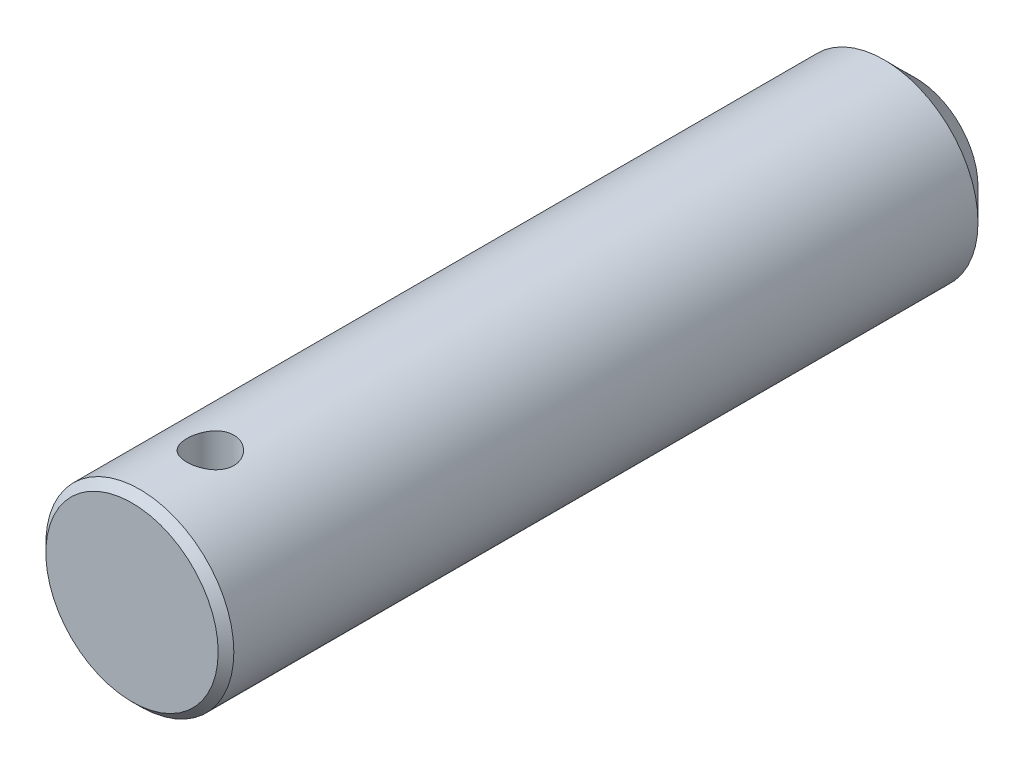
ISO-10303-21;
HEADER;
FILE_DESCRIPTION(('STEP AP214'),'2;1');
FILE_NAME('part.step','',(''),(''),'','','');
FILE_SCHEMA(('AUTOMOTIVE_DESIGN { 1 0 10303 214 1 1 1 1 }'));
ENDSEC;
DATA;
#1=APPLICATION_CONTEXT('core data for automotive mechanical design processes');
#2=APPLICATION_PROTOCOL_DEFINITION('international standard','automotive_design',2000,#1);
#3=PRODUCT_CONTEXT('',#1,'mechanical');
#4=PRODUCT('Part','Part','',(#3));
#5=PRODUCT_RELATED_PRODUCT_CATEGORY('part','',(#4));
#6=PRODUCT_DEFINITION_FORMATION('','',#4);
#7=PRODUCT_DEFINITION_CONTEXT('part definition',#1,'design');
#8=PRODUCT_DEFINITION('design','',#6,#7);
#9=PRODUCT_DEFINITION_SHAPE('','',#8);
#10=(LENGTH_UNIT() NAMED_UNIT(*) SI_UNIT(.MILLI.,.METRE.));
#11=(NAMED_UNIT(*) PLANE_ANGLE_UNIT() SI_UNIT($,.RADIAN.));
#12=(NAMED_UNIT(*) SI_UNIT($,.STERADIAN.) SOLID_ANGLE_UNIT());
#13=UNCERTAINTY_MEASURE_WITH_UNIT(LENGTH_MEASURE(1.E-05),#10,'distance_accuracy_value','');
#14=(GEOMETRIC_REPRESENTATION_CONTEXT(3) GLOBAL_UNCERTAINTY_ASSIGNED_CONTEXT((#13)) GLOBAL_UNIT_ASSIGNED_CONTEXT((#10,
#11,#12)) REPRESENTATION_CONTEXT('',''));
#15=CARTESIAN_POINT('',(0.,0.,0.));
#16=DIRECTION('',(0.,0.,1.));
#17=DIRECTION('',(1.,0.,0.));
#18=AXIS2_PLACEMENT_3D('',#15,#16,#17);
#19=CARTESIAN_POINT('',(0.,0.,50.));
#20=DIRECTION('',(0.,0.,-1.));
#21=DIRECTION('',(-1.,0.,0.));
#22=AXIS2_PLACEMENT_3D('',#19,#20,#21);
#23=CYLINDRICAL_SURFACE('',#22,6.);
#24=CARTESIAN_POINT('',(0.,0.,49.5));
#25=DIRECTION('',(0.,0.,1.));
#26=DIRECTION('',(1.,0.,0.));
#27=AXIS2_PLACEMENT_3D('',#24,#25,#26);
#28=CIRCLE('',#27,6.);
#29=CARTESIAN_POINT('',(6.,0.,49.5));
#30=VERTEX_POINT('',#29);
#31=EDGE_CURVE('E10',#30,#30,#28,.F.);
#32=ORIENTED_EDGE('',*,*,#31,.T.);
#33=EDGE_LOOP('',(#32));
#34=FACE_BOUND('',#33,.T.);
#35=CARTESIAN_POINT('',(0.,-6.,46.5));
#36=CARTESIAN_POINT('',(0.0828760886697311,-5.99999859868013,46.4999976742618));
#37=CARTESIAN_POINT('',(0.165778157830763,-5.99826578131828,46.4931084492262));
#38=CARTESIAN_POINT('',(0.329206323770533,-5.99152113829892,46.465774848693));
#39=CARTESIAN_POINT('',(0.40973104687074,-5.98650745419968,46.4453227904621));
#40=CARTESIAN_POINT('',(0.566020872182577,-5.9737562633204,46.3915607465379));
#41=CARTESIAN_POINT('',(0.641791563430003,-5.96602202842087,46.3582662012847));
#42=CARTESIAN_POINT('',(0.786672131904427,-5.94865343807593,46.2798186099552));
#43=CARTESIAN_POINT('',(0.85578178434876,-5.9390190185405,46.2346651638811));
#44=CARTESIAN_POINT('',(0.986801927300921,-5.91867413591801,46.1327992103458));
#45=CARTESIAN_POINT('',(1.04855569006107,-5.90794707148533,46.0758884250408));
#46=CARTESIAN_POINT('',(1.1617489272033,-5.8867362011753,45.9525477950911));
#47=CARTESIAN_POINT('',(1.21318723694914,-5.87625242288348,45.8861168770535));
#48=CARTESIAN_POINT('',(1.30502654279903,-5.8565477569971,45.7444047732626));
#49=CARTESIAN_POINT('',(1.34525221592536,-5.84734794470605,45.6690067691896));
#50=CARTESIAN_POINT('',(1.41239690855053,-5.83149494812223,45.5122515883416));
#51=CARTESIAN_POINT('',(1.43931805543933,-5.82484135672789,45.4308953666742));
#52=CARTESIAN_POINT('',(1.47855483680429,-5.81500476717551,45.2662565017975));
#53=CARTESIAN_POINT('',(1.49115226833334,-5.81175491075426,45.1830451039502));
#54=CARTESIAN_POINT('',(1.50226177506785,-5.80889362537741,45.015631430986));
#55=CARTESIAN_POINT('',(1.50077614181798,-5.80928160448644,44.9314293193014));
#56=CARTESIAN_POINT('',(1.48398652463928,-5.81359205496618,44.7665841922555));
#57=CARTESIAN_POINT('',(1.46901834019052,-5.81742863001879,44.6859043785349));
#58=CARTESIAN_POINT('',(1.42622418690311,-5.82806709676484,44.5282389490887));
#59=CARTESIAN_POINT('',(1.39839730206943,-5.83486919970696,44.451253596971));
#60=CARTESIAN_POINT('',(1.33038947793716,-5.85075113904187,44.3022619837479));
#61=CARTESIAN_POINT('',(1.29008666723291,-5.85985327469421,44.2303138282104));
#62=CARTESIAN_POINT('',(1.19835627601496,-5.87929710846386,44.0940812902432));
#63=CARTESIAN_POINT('',(1.14692674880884,-5.88963902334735,44.0297982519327));
#64=CARTESIAN_POINT('',(1.03266342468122,-5.91075880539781,43.9087963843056));
#65=CARTESIAN_POINT('',(0.969546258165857,-5.92154069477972,43.8523455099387));
#66=CARTESIAN_POINT('',(0.834611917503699,-5.94205965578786,43.7507787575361));
#67=CARTESIAN_POINT('',(0.762794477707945,-5.95179669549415,43.7056632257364));
#68=CARTESIAN_POINT('',(0.612115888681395,-5.96917732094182,43.6279494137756));
#69=CARTESIAN_POINT('',(0.533231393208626,-5.97681360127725,43.5953946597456));
#70=CARTESIAN_POINT('',(0.370876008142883,-5.98907916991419,43.5440826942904));
#71=CARTESIAN_POINT('',(0.287405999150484,-5.99370903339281,43.5253228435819));
#72=CARTESIAN_POINT('',(0.120539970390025,-5.99935499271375,43.5025424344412));
#73=CARTESIAN_POINT('',(0.0371967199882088,-6.00046053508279,43.4981569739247));
#74=CARTESIAN_POINT('',(-0.129032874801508,-5.99918804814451,43.5032490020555));
#75=CARTESIAN_POINT('',(-0.211919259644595,-5.99681033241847,43.5127252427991));
#76=CARTESIAN_POINT('',(-0.373614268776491,-5.98889581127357,43.5449709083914));
#77=CARTESIAN_POINT('',(-0.452465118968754,-5.98340634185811,43.567541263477));
#78=CARTESIAN_POINT('',(-0.605257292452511,-5.96988706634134,43.6251070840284));
#79=CARTESIAN_POINT('',(-0.679198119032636,-5.96185700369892,43.6601038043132));
#80=CARTESIAN_POINT('',(-0.821523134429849,-5.9439330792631,43.7422361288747));
#81=CARTESIAN_POINT('',(-0.889785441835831,-5.93400867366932,43.7895761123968));
#82=CARTESIAN_POINT('',(-1.01752661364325,-5.91344509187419,43.894789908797));
#83=CARTESIAN_POINT('',(-1.07700395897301,-5.90280579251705,43.9526655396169));
#84=CARTESIAN_POINT('',(-1.18699056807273,-5.88168956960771,44.0790019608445));
#85=CARTESIAN_POINT('',(-1.23724386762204,-5.87122304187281,44.1476877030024));
#86=CARTESIAN_POINT('',(-1.3255107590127,-5.85192878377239,44.2927326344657));
#87=CARTESIAN_POINT('',(-1.36352489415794,-5.84310098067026,44.3690914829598));
#88=CARTESIAN_POINT('',(-1.42595142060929,-5.82818094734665,44.5269057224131));
#89=CARTESIAN_POINT('',(-1.45044439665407,-5.82207255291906,44.608327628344));
#90=CARTESIAN_POINT('',(-1.48534565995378,-5.81326744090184,44.7743096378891));
#91=CARTESIAN_POINT('',(-1.49575702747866,-5.81056997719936,44.8588690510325));
#92=CARTESIAN_POINT('',(-1.502038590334,-5.80894901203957,45.0261210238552));
#93=CARTESIAN_POINT('',(-1.49831789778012,-5.80991932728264,45.1087974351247));
#94=CARTESIAN_POINT('',(-1.47737727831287,-5.81527909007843,45.272303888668));
#95=CARTESIAN_POINT('',(-1.46015762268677,-5.81966846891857,45.3531339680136));
#96=CARTESIAN_POINT('',(-1.4129313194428,-5.83131260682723,45.5102084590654));
#97=CARTESIAN_POINT('',(-1.38300140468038,-5.83855015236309,45.5864773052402));
#98=CARTESIAN_POINT('',(-1.31126491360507,-5.85507755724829,45.7329653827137));
#99=CARTESIAN_POINT('',(-1.26945669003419,-5.86436770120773,45.8031837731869));
#100=CARTESIAN_POINT('',(-1.17386774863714,-5.88425634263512,45.937554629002));
#101=CARTESIAN_POINT('',(-1.11980316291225,-5.89488264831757,46.001501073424));
#102=CARTESIAN_POINT('',(-1.00178937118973,-5.91608027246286,46.1195470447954));
#103=CARTESIAN_POINT('',(-0.937837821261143,-5.9266515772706,46.173644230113));
#104=CARTESIAN_POINT('',(-0.800467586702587,-5.94677655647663,46.2714113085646));
#105=CARTESIAN_POINT('',(-0.726898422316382,-5.95630833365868,46.3148746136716));
#106=CARTESIAN_POINT('',(-0.573266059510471,-5.97304924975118,46.3887474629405));
#107=CARTESIAN_POINT('',(-0.493207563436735,-5.98026005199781,46.4191663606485));
#108=CARTESIAN_POINT('',(-0.34441025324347,-5.99048059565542,46.4615718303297));
#109=CARTESIAN_POINT('',(-0.276380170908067,-5.99402585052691,46.4759512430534));
#110=CARTESIAN_POINT('',(-0.138906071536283,-5.99878605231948,46.4951659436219));
#111=CARTESIAN_POINT('',(-0.0694621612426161,-6.00000117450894,46.5000019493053));
#112=CARTESIAN_POINT('',(0.,-6.,46.5));
#113=B_SPLINE_CURVE_WITH_KNOTS('',3,(#35,#36,#37,#38,#39,#40,#41,#42,#43,#44,#45,#46,#47,#48,
#49,#50,#51,#52,#53,#54,#55,#56,#57,#58,#59,#60,#61,#62,#63,#64,#65,#66,#67,#68,#69,#70,#71,#72,
#73,#74,#75,#76,#77,#78,#79,#80,#81,#82,#83,#84,#85,#86,#87,#88,#89,#90,#91,#92,#93,#94,#95,#96,
#97,#98,#99,#100,#101,#102,#103,#104,#105,#106,#107,#108,#109,#110,#111,#112),.UNSPECIFIED.,.T.,
.F.,(4,2,2,2,2,2,2,2,2,2,2,2,2,2,2,2,2,2,2,2,2,2,2,2,2,2,2,2,2,2,2,2,2,2,2,2,2,2,4),(0.,
0.248373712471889,0.4968882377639,0.745104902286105,0.993329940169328,1.24614435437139,
1.49898729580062,1.75558647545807,2.01214461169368,2.2635629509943,2.51494038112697,
2.76022497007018,3.00552703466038,3.25330527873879,3.50112690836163,3.7560150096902,
4.01091089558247,4.26668229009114,4.52240473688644,4.77158308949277,5.02073901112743,
5.26620274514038,5.51169127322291,5.76153587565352,6.0114236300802,6.26744509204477,
6.52345518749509,6.77792254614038,7.03233423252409,7.27943780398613,7.52653640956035,
7.77216400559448,8.01782568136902,8.26989576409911,8.52202569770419,8.77872185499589,
9.03523363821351,9.2434224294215,9.4515955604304),.UNSPECIFIED.);
#114=CARTESIAN_POINT('',(0.,-6.,46.5));
#115=VERTEX_POINT('',#114);
#116=EDGE_CURVE('E51',#115,#115,#113,.T.);
#117=ORIENTED_EDGE('',*,*,#116,.T.);
#118=EDGE_LOOP('',(#117));
#119=FACE_BOUND('',#118,.T.);
#120=CARTESIAN_POINT('',(0.,6.,46.5));
#121=CARTESIAN_POINT('',(-0.0828760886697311,5.99999859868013,46.4999976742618));
#122=CARTESIAN_POINT('',(-0.165778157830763,5.99826578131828,46.4931084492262));
#123=CARTESIAN_POINT('',(-0.329206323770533,5.99152113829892,46.465774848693));
#124=CARTESIAN_POINT('',(-0.40973104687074,5.98650745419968,46.4453227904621));
#125=CARTESIAN_POINT('',(-0.566020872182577,5.9737562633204,46.3915607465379));
#126=CARTESIAN_POINT('',(-0.641791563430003,5.96602202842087,46.3582662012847));
#127=CARTESIAN_POINT('',(-0.786672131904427,5.94865343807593,46.2798186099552));
#128=CARTESIAN_POINT('',(-0.85578178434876,5.9390190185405,46.2346651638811));
#129=CARTESIAN_POINT('',(-0.986801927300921,5.91867413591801,46.1327992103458));
#130=CARTESIAN_POINT('',(-1.04855569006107,5.90794707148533,46.0758884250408));
#131=CARTESIAN_POINT('',(-1.1617489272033,5.8867362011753,45.9525477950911));
#132=CARTESIAN_POINT('',(-1.21318723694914,5.87625242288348,45.8861168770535));
#133=CARTESIAN_POINT('',(-1.30502654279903,5.8565477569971,45.7444047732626));
#134=CARTESIAN_POINT('',(-1.34525221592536,5.84734794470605,45.6690067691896));
#135=CARTESIAN_POINT('',(-1.41239690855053,5.83149494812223,45.5122515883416));
#136=CARTESIAN_POINT('',(-1.43931805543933,5.82484135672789,45.4308953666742));
#137=CARTESIAN_POINT('',(-1.47855483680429,5.81500476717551,45.2662565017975));
#138=CARTESIAN_POINT('',(-1.49115226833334,5.81175491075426,45.1830451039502));
#139=CARTESIAN_POINT('',(-1.50226177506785,5.80889362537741,45.015631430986));
#140=CARTESIAN_POINT('',(-1.50077614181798,5.80928160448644,44.9314293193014));
#141=CARTESIAN_POINT('',(-1.48398652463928,5.81359205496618,44.7665841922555));
#142=CARTESIAN_POINT('',(-1.46901834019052,5.81742863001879,44.6859043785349));
#143=CARTESIAN_POINT('',(-1.42622418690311,5.82806709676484,44.5282389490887));
#144=CARTESIAN_POINT('',(-1.39839730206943,5.83486919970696,44.451253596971));
#145=CARTESIAN_POINT('',(-1.33038947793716,5.85075113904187,44.3022619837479));
#146=CARTESIAN_POINT('',(-1.29008666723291,5.85985327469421,44.2303138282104));
#147=CARTESIAN_POINT('',(-1.19835627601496,5.87929710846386,44.0940812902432));
#148=CARTESIAN_POINT('',(-1.14692674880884,5.88963902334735,44.0297982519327));
#149=CARTESIAN_POINT('',(-1.03266342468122,5.91075880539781,43.9087963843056));
#150=CARTESIAN_POINT('',(-0.969546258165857,5.92154069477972,43.8523455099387));
#151=CARTESIAN_POINT('',(-0.834611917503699,5.94205965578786,43.7507787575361));
#152=CARTESIAN_POINT('',(-0.762794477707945,5.95179669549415,43.7056632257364));
#153=CARTESIAN_POINT('',(-0.612115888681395,5.96917732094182,43.6279494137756));
#154=CARTESIAN_POINT('',(-0.533231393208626,5.97681360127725,43.5953946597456));
#155=CARTESIAN_POINT('',(-0.370876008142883,5.98907916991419,43.5440826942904));
#156=CARTESIAN_POINT('',(-0.287405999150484,5.99370903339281,43.5253228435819));
#157=CARTESIAN_POINT('',(-0.120539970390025,5.99935499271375,43.5025424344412));
#158=CARTESIAN_POINT('',(-0.0371967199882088,6.00046053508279,43.4981569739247));
#159=CARTESIAN_POINT('',(0.129032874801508,5.99918804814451,43.5032490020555));
#160=CARTESIAN_POINT('',(0.211919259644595,5.99681033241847,43.5127252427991));
#161=CARTESIAN_POINT('',(0.373614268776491,5.98889581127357,43.5449709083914));
#162=CARTESIAN_POINT('',(0.452465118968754,5.98340634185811,43.567541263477));
#163=CARTESIAN_POINT('',(0.605257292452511,5.96988706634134,43.6251070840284));
#164=CARTESIAN_POINT('',(0.679198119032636,5.96185700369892,43.6601038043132));
#165=CARTESIAN_POINT('',(0.821523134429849,5.9439330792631,43.7422361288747));
#166=CARTESIAN_POINT('',(0.889785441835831,5.93400867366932,43.7895761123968));
#167=CARTESIAN_POINT('',(1.01752661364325,5.91344509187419,43.894789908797));
#168=CARTESIAN_POINT('',(1.07700395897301,5.90280579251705,43.9526655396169));
#169=CARTESIAN_POINT('',(1.18699056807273,5.88168956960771,44.0790019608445));
#170=CARTESIAN_POINT('',(1.23724386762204,5.87122304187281,44.1476877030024));
#171=CARTESIAN_POINT('',(1.3255107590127,5.85192878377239,44.2927326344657));
#172=CARTESIAN_POINT('',(1.36352489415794,5.84310098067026,44.3690914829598));
#173=CARTESIAN_POINT('',(1.42595142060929,5.82818094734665,44.5269057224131));
#174=CARTESIAN_POINT('',(1.45044439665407,5.82207255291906,44.608327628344));
#175=CARTESIAN_POINT('',(1.48534565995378,5.81326744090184,44.7743096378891));
#176=CARTESIAN_POINT('',(1.49575702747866,5.81056997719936,44.8588690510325));
#177=CARTESIAN_POINT('',(1.502038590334,5.80894901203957,45.0261210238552));
#178=CARTESIAN_POINT('',(1.49831789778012,5.80991932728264,45.1087974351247));
#179=CARTESIAN_POINT('',(1.47737727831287,5.81527909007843,45.272303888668));
#180=CARTESIAN_POINT('',(1.46015762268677,5.81966846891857,45.3531339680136));
#181=CARTESIAN_POINT('',(1.4129313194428,5.83131260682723,45.5102084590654));
#182=CARTESIAN_POINT('',(1.38300140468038,5.83855015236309,45.5864773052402));
#183=CARTESIAN_POINT('',(1.31126491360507,5.85507755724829,45.7329653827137));
#184=CARTESIAN_POINT('',(1.26945669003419,5.86436770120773,45.8031837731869));
#185=CARTESIAN_POINT('',(1.17386774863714,5.88425634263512,45.937554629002));
#186=CARTESIAN_POINT('',(1.11980316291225,5.89488264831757,46.001501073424));
#187=CARTESIAN_POINT('',(1.00178937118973,5.91608027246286,46.1195470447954));
#188=CARTESIAN_POINT('',(0.937837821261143,5.9266515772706,46.173644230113));
#189=CARTESIAN_POINT('',(0.800467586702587,5.94677655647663,46.2714113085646));
#190=CARTESIAN_POINT('',(0.726898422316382,5.95630833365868,46.3148746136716));
#191=CARTESIAN_POINT('',(0.573266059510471,5.97304924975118,46.3887474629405));
#192=CARTESIAN_POINT('',(0.493207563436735,5.98026005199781,46.4191663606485));
#193=CARTESIAN_POINT('',(0.34441025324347,5.99048059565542,46.4615718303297));
#194=CARTESIAN_POINT('',(0.276380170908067,5.99402585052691,46.4759512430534));
#195=CARTESIAN_POINT('',(0.138906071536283,5.99878605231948,46.4951659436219));
#196=CARTESIAN_POINT('',(0.0694621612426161,6.00000117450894,46.5000019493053));
#197=CARTESIAN_POINT('',(0.,6.,46.5));
#198=B_SPLINE_CURVE_WITH_KNOTS('',3,(#120,#121,#122,#123,#124,#125,#126,#127,#128,#129,#130,
#131,#132,#133,#134,#135,#136,#137,#138,#139,#140,#141,#142,#143,#144,#145,#146,#147,#148,#149,
#150,#151,#152,#153,#154,#155,#156,#157,#158,#159,#160,#161,#162,#163,#164,#165,#166,#167,#168,
#169,#170,#171,#172,#173,#174,#175,#176,#177,#178,#179,#180,#181,#182,#183,#184,#185,#186,#187,
#188,#189,#190,#191,#192,#193,#194,#195,#196,#197),.UNSPECIFIED.,.T.,.F.,(4,2,2,2,2,2,2,2,2,2,2,
2,2,2,2,2,2,2,2,2,2,2,2,2,2,2,2,2,2,2,2,2,2,2,2,2,2,2,4),(0.,0.248373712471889,0.4968882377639,
0.745104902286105,0.993329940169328,1.24614435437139,1.49898729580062,1.75558647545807,
2.01214461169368,2.2635629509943,2.51494038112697,2.76022497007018,3.00552703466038,
3.25330527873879,3.50112690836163,3.7560150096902,4.01091089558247,4.26668229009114,
4.52240473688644,4.77158308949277,5.02073901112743,5.26620274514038,5.51169127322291,
5.76153587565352,6.0114236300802,6.26744509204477,6.52345518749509,6.77792254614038,
7.03233423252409,7.27943780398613,7.52653640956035,7.77216400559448,8.01782568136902,
8.26989576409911,8.52202569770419,8.77872185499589,9.03523363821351,9.2434224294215,
9.4515955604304),.UNSPECIFIED.);
#199=CARTESIAN_POINT('',(0.,6.,46.5));
#200=VERTEX_POINT('',#199);
#201=EDGE_CURVE('E58',#200,#200,#198,.T.);
#202=ORIENTED_EDGE('',*,*,#201,.T.);
#203=EDGE_LOOP('',(#202));
#204=FACE_BOUND('',#203,.T.);
#205=CARTESIAN_POINT('',(0.,0.,1.99999999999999));
#206=DIRECTION('',(0.,0.,1.));
#207=DIRECTION('',(1.,0.,0.));
#208=AXIS2_PLACEMENT_3D('',#205,#206,#207);
#209=CIRCLE('',#208,6.);
#210=CARTESIAN_POINT('',(6.,0.,1.99999999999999));
#211=VERTEX_POINT('',#210);
#212=EDGE_CURVE('E48',#211,#211,#209,.T.);
#213=ORIENTED_EDGE('',*,*,#212,.T.);
#214=EDGE_LOOP('',(#213));
#215=FACE_BOUND('',#214,.T.);
#216=ADVANCED_FACE('F33',(#34,#119,#204,#215),#23,.T.);
#217=CARTESIAN_POINT('',(0.,0.,50.));
#218=DIRECTION('',(0.,0.,1.));
#219=DIRECTION('',(1.,0.,0.));
#220=AXIS2_PLACEMENT_3D('',#217,#218,#219);
#221=PLANE('',#220);
#222=CARTESIAN_POINT('',(0.,0.,50.));
#223=DIRECTION('',(0.,0.,1.));
#224=DIRECTION('',(1.,0.,0.));
#225=AXIS2_PLACEMENT_3D('',#222,#223,#224);
#226=CIRCLE('',#225,5.49999999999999);
#227=CARTESIAN_POINT('',(5.49999999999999,0.,50.));
#228=VERTEX_POINT('',#227);
#229=EDGE_CURVE('E40',#228,#228,#226,.T.);
#230=ORIENTED_EDGE('',*,*,#229,.T.);
#231=EDGE_LOOP('',(#230));
#232=FACE_BOUND('',#231,.T.);
#233=ADVANCED_FACE('F69',(#232),#221,.T.);
#234=CARTESIAN_POINT('',(0.,0.,0.));
#235=DIRECTION('',(0.,0.,1.));
#236=DIRECTION('',(1.,0.,0.));
#237=AXIS2_PLACEMENT_3D('',#234,#235,#236);
#238=PLANE('',#237);
#239=CARTESIAN_POINT('',(0.,0.,0.));
#240=DIRECTION('',(0.,0.,1.));
#241=DIRECTION('',(1.,0.,0.));
#242=AXIS2_PLACEMENT_3D('',#239,#240,#241);
#243=CIRCLE('',#242,3.99999999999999);
#244=CARTESIAN_POINT('',(3.99999999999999,0.,0.));
#245=VERTEX_POINT('',#244);
#246=EDGE_CURVE('E44',#245,#245,#243,.F.);
#247=ORIENTED_EDGE('',*,*,#246,.T.);
#248=EDGE_LOOP('',(#247));
#249=FACE_BOUND('',#248,.T.);
#250=ADVANCED_FACE('F72',(#249),#238,.F.);
#251=CARTESIAN_POINT('',(0.,0.,1.99999999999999));
#252=DIRECTION('',(0.,0.,1.));
#253=DIRECTION('',(1.,0.,0.));
#254=AXIS2_PLACEMENT_3D('',#251,#252,#253);
#255=CONICAL_SURFACE('',#254,6.,0.785398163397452);
#256=ORIENTED_EDGE('',*,*,#246,.F.);
#257=EDGE_LOOP('',(#256));
#258=FACE_BOUND('',#257,.T.);
#259=ORIENTED_EDGE('',*,*,#212,.F.);
#260=EDGE_LOOP('',(#259));
#261=FACE_BOUND('',#260,.T.);
#262=ADVANCED_FACE('F67',(#258,#261),#255,.T.);
#263=CARTESIAN_POINT('',(0.,-10.,45.));
#264=DIRECTION('',(0.,1.,0.));
#265=DIRECTION('',(0.,0.,1.));
#266=AXIS2_PLACEMENT_3D('',#263,#264,#265);
#267=CYLINDRICAL_SURFACE('',#266,1.5);
#268=ORIENTED_EDGE('',*,*,#201,.F.);
#269=EDGE_LOOP('',(#268));
#270=FACE_BOUND('',#269,.T.);
#271=ORIENTED_EDGE('',*,*,#116,.F.);
#272=EDGE_LOOP('',(#271));
#273=FACE_BOUND('',#272,.T.);
#274=ADVANCED_FACE('F63',(#270,#273),#267,.F.);
#275=CARTESIAN_POINT('',(0.,0.,50.));
#276=DIRECTION('',(0.,0.,-1.));
#277=DIRECTION('',(-1.,0.,0.));
#278=AXIS2_PLACEMENT_3D('',#275,#276,#277);
#279=CONICAL_SURFACE('',#278,5.49999999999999,0.785398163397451);
#280=ORIENTED_EDGE('',*,*,#31,.F.);
#281=EDGE_LOOP('',(#280));
#282=FACE_BOUND('',#281,.T.);
#283=ORIENTED_EDGE('',*,*,#229,.F.);
#284=EDGE_LOOP('',(#283));
#285=FACE_BOUND('',#284,.T.);
#286=ADVANCED_FACE('F35',(#282,#285),#279,.T.);
#287=CLOSED_SHELL('',(#216,#233,#250,#262,#274,#286));
#288=MANIFOLD_SOLID_BREP('B2',#287);
#289=ADVANCED_BREP_SHAPE_REPRESENTATION('',(#18,#288),#14);
#290=SHAPE_DEFINITION_REPRESENTATION(#9,#289);
ENDSEC;
END-ISO-10303-21;
